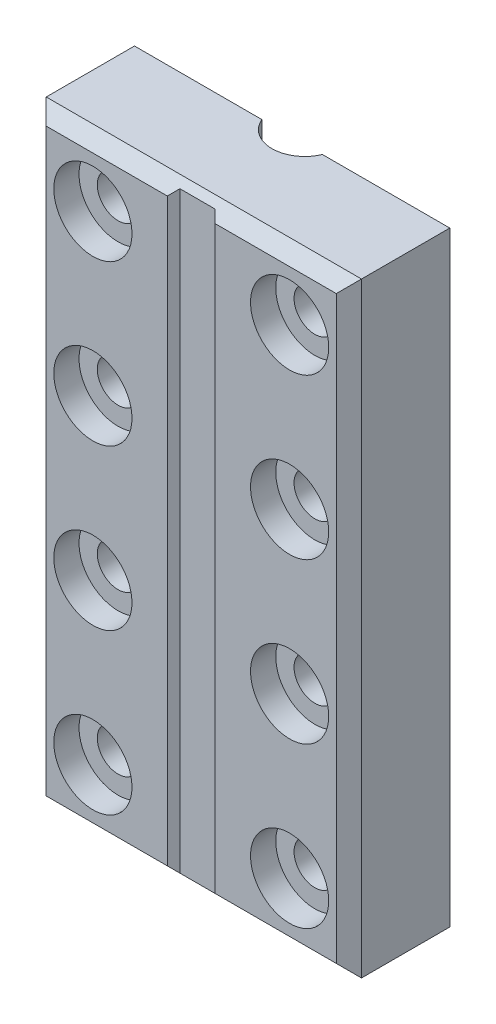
ISO-10303-21;
HEADER;
FILE_DESCRIPTION(('STEP AP214'),'2;1');
FILE_NAME('part.step','',(''),(''),'','','');
FILE_SCHEMA(('AUTOMOTIVE_DESIGN { 1 0 10303 214 1 1 1 1 }'));
ENDSEC;
DATA;
#1=APPLICATION_CONTEXT('core data for automotive mechanical design processes');
#2=APPLICATION_PROTOCOL_DEFINITION('international standard','automotive_design',2000,#1);
#3=PRODUCT_CONTEXT('',#1,'mechanical');
#4=PRODUCT('Part','Part','',(#3));
#5=PRODUCT_RELATED_PRODUCT_CATEGORY('part','',(#4));
#6=PRODUCT_DEFINITION_FORMATION('','',#4);
#7=PRODUCT_DEFINITION_CONTEXT('part definition',#1,'design');
#8=PRODUCT_DEFINITION('design','',#6,#7);
#9=PRODUCT_DEFINITION_SHAPE('','',#8);
#10=(LENGTH_UNIT() NAMED_UNIT(*) SI_UNIT(.MILLI.,.METRE.));
#11=(NAMED_UNIT(*) PLANE_ANGLE_UNIT() SI_UNIT($,.RADIAN.));
#12=(NAMED_UNIT(*) SI_UNIT($,.STERADIAN.) SOLID_ANGLE_UNIT());
#13=UNCERTAINTY_MEASURE_WITH_UNIT(LENGTH_MEASURE(1.E-05),#10,'distance_accuracy_value','');
#14=(GEOMETRIC_REPRESENTATION_CONTEXT(3) GLOBAL_UNCERTAINTY_ASSIGNED_CONTEXT((#13)) GLOBAL_UNIT_ASSIGNED_CONTEXT((#10,
#11,#12)) REPRESENTATION_CONTEXT('',''));
#15=CARTESIAN_POINT('',(0.,0.,0.));
#16=DIRECTION('',(0.,0.,1.));
#17=DIRECTION('',(1.,0.,0.));
#18=AXIS2_PLACEMENT_3D('',#15,#16,#17);
#19=CARTESIAN_POINT('',(-56.3000000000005,-19.0000000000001,8.));
#20=DIRECTION('',(0.,0.,-1.));
#21=DIRECTION('',(-1.,0.,0.));
#22=AXIS2_PLACEMENT_3D('',#19,#20,#21);
#23=CYLINDRICAL_SURFACE('',#22,1.65);
#24=CARTESIAN_POINT('',(-56.3000000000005,-19.0000000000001,0.));
#25=DIRECTION('',(0.,0.,1.));
#26=DIRECTION('',(1.,0.,0.));
#27=AXIS2_PLACEMENT_3D('',#24,#25,#26);
#28=CIRCLE('',#27,1.65);
#29=CARTESIAN_POINT('',(-54.6500000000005,-19.0000000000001,0.));
#30=VERTEX_POINT('',#29);
#31=EDGE_CURVE('E165',#30,#30,#28,.T.);
#32=ORIENTED_EDGE('',*,*,#31,.F.);
#33=EDGE_LOOP('',(#32));
#34=FACE_BOUND('',#33,.T.);
#35=CARTESIAN_POINT('',(-56.3000000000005,-19.0000000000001,6.));
#36=DIRECTION('',(0.,0.,1.));
#37=DIRECTION('',(1.,0.,0.));
#38=AXIS2_PLACEMENT_3D('',#35,#36,#37);
#39=CIRCLE('',#38,1.65);
#40=CARTESIAN_POINT('',(-54.6500000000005,-19.0000000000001,6.));
#41=VERTEX_POINT('',#40);
#42=EDGE_CURVE('E40',#41,#41,#39,.T.);
#43=ORIENTED_EDGE('',*,*,#42,.T.);
#44=EDGE_LOOP('',(#43));
#45=FACE_BOUND('',#44,.T.);
#46=ADVANCED_FACE('F35',(#34,#45),#23,.F.);
#47=CARTESIAN_POINT('',(-56.3000000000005,-31.6666666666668,8.));
#48=DIRECTION('',(0.,0.,-1.));
#49=DIRECTION('',(-1.,0.,0.));
#50=AXIS2_PLACEMENT_3D('',#47,#48,#49);
#51=CYLINDRICAL_SURFACE('',#50,1.65);
#52=CARTESIAN_POINT('',(-56.3000000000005,-31.6666666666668,0.));
#53=DIRECTION('',(0.,0.,1.));
#54=DIRECTION('',(1.,0.,0.));
#55=AXIS2_PLACEMENT_3D('',#52,#53,#54);
#56=CIRCLE('',#55,1.65);
#57=CARTESIAN_POINT('',(-54.6500000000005,-31.6666666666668,0.));
#58=VERTEX_POINT('',#57);
#59=EDGE_CURVE('E162',#58,#58,#56,.T.);
#60=ORIENTED_EDGE('',*,*,#59,.F.);
#61=EDGE_LOOP('',(#60));
#62=FACE_BOUND('',#61,.T.);
#63=CARTESIAN_POINT('',(-56.3000000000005,-31.6666666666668,6.));
#64=DIRECTION('',(0.,0.,1.));
#65=DIRECTION('',(1.,0.,0.));
#66=AXIS2_PLACEMENT_3D('',#63,#64,#65);
#67=CIRCLE('',#66,1.65);
#68=CARTESIAN_POINT('',(-54.6500000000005,-31.6666666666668,6.));
#69=VERTEX_POINT('',#68);
#70=EDGE_CURVE('E255',#69,#69,#67,.T.);
#71=ORIENTED_EDGE('',*,*,#70,.T.);
#72=EDGE_LOOP('',(#71));
#73=FACE_BOUND('',#72,.T.);
#74=ADVANCED_FACE('F421',(#62,#73),#51,.F.);
#75=CARTESIAN_POINT('',(-56.3000000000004,-44.3333333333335,8.));
#76=DIRECTION('',(0.,0.,-1.));
#77=DIRECTION('',(-1.,0.,0.));
#78=AXIS2_PLACEMENT_3D('',#75,#76,#77);
#79=CYLINDRICAL_SURFACE('',#78,1.65);
#80=CARTESIAN_POINT('',(-56.3000000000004,-44.3333333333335,0.));
#81=DIRECTION('',(0.,0.,1.));
#82=DIRECTION('',(1.,0.,0.));
#83=AXIS2_PLACEMENT_3D('',#80,#81,#82);
#84=CIRCLE('',#83,1.65);
#85=CARTESIAN_POINT('',(-54.6500000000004,-44.3333333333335,0.));
#86=VERTEX_POINT('',#85);
#87=EDGE_CURVE('E159',#86,#86,#84,.T.);
#88=ORIENTED_EDGE('',*,*,#87,.F.);
#89=EDGE_LOOP('',(#88));
#90=FACE_BOUND('',#89,.T.);
#91=CARTESIAN_POINT('',(-56.3000000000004,-44.3333333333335,6.));
#92=DIRECTION('',(0.,0.,1.));
#93=DIRECTION('',(1.,0.,0.));
#94=AXIS2_PLACEMENT_3D('',#91,#92,#93);
#95=CIRCLE('',#94,1.65);
#96=CARTESIAN_POINT('',(-54.6500000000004,-44.3333333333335,6.));
#97=VERTEX_POINT('',#96);
#98=EDGE_CURVE('E253',#97,#97,#95,.T.);
#99=ORIENTED_EDGE('',*,*,#98,.T.);
#100=EDGE_LOOP('',(#99));
#101=FACE_BOUND('',#100,.T.);
#102=ADVANCED_FACE('F427',(#90,#101),#79,.F.);
#103=CARTESIAN_POINT('',(-56.3000000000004,-57.0000000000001,8.));
#104=DIRECTION('',(0.,0.,-1.));
#105=DIRECTION('',(-1.,0.,0.));
#106=AXIS2_PLACEMENT_3D('',#103,#104,#105);
#107=CYLINDRICAL_SURFACE('',#106,1.65);
#108=CARTESIAN_POINT('',(-56.3000000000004,-57.0000000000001,0.));
#109=DIRECTION('',(0.,0.,1.));
#110=DIRECTION('',(1.,0.,0.));
#111=AXIS2_PLACEMENT_3D('',#108,#109,#110);
#112=CIRCLE('',#111,1.65);
#113=CARTESIAN_POINT('',(-54.6500000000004,-57.0000000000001,0.));
#114=VERTEX_POINT('',#113);
#115=EDGE_CURVE('E156',#114,#114,#112,.T.);
#116=ORIENTED_EDGE('',*,*,#115,.F.);
#117=EDGE_LOOP('',(#116));
#118=FACE_BOUND('',#117,.T.);
#119=CARTESIAN_POINT('',(-56.3000000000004,-57.0000000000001,6.));
#120=DIRECTION('',(0.,0.,1.));
#121=DIRECTION('',(1.,0.,0.));
#122=AXIS2_PLACEMENT_3D('',#119,#120,#121);
#123=CIRCLE('',#122,1.65);
#124=CARTESIAN_POINT('',(-54.6500000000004,-57.0000000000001,6.));
#125=VERTEX_POINT('',#124);
#126=EDGE_CURVE('E250',#125,#125,#123,.T.);
#127=ORIENTED_EDGE('',*,*,#126,.T.);
#128=EDGE_LOOP('',(#127));
#129=FACE_BOUND('',#128,.T.);
#130=ADVANCED_FACE('F295',(#118,#129),#107,.F.);
#131=CARTESIAN_POINT('',(-40.7,-19.0000000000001,8.));
#132=DIRECTION('',(0.,0.,-1.));
#133=DIRECTION('',(-1.,0.,0.));
#134=AXIS2_PLACEMENT_3D('',#131,#132,#133);
#135=CYLINDRICAL_SURFACE('',#134,1.65);
#136=CARTESIAN_POINT('',(-40.7,-19.0000000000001,0.));
#137=DIRECTION('',(0.,0.,1.));
#138=DIRECTION('',(1.,0.,0.));
#139=AXIS2_PLACEMENT_3D('',#136,#137,#138);
#140=CIRCLE('',#139,1.65);
#141=CARTESIAN_POINT('',(-39.05,-19.0000000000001,0.));
#142=VERTEX_POINT('',#141);
#143=EDGE_CURVE('E140',#142,#142,#140,.T.);
#144=ORIENTED_EDGE('',*,*,#143,.F.);
#145=EDGE_LOOP('',(#144));
#146=FACE_BOUND('',#145,.T.);
#147=CARTESIAN_POINT('',(-40.7,-19.0000000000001,6.));
#148=DIRECTION('',(0.,0.,1.));
#149=DIRECTION('',(1.,0.,0.));
#150=AXIS2_PLACEMENT_3D('',#147,#148,#149);
#151=CIRCLE('',#150,1.65);
#152=CARTESIAN_POINT('',(-39.05,-19.0000000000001,6.));
#153=VERTEX_POINT('',#152);
#154=EDGE_CURVE('E247',#153,#153,#151,.T.);
#155=ORIENTED_EDGE('',*,*,#154,.T.);
#156=EDGE_LOOP('',(#155));
#157=FACE_BOUND('',#156,.T.);
#158=ADVANCED_FACE('F291',(#146,#157),#135,.F.);
#159=CARTESIAN_POINT('',(-40.6999999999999,-31.6666666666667,8.));
#160=DIRECTION('',(0.,0.,-1.));
#161=DIRECTION('',(-1.,0.,0.));
#162=AXIS2_PLACEMENT_3D('',#159,#160,#161);
#163=CYLINDRICAL_SURFACE('',#162,1.65);
#164=CARTESIAN_POINT('',(-40.6999999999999,-31.6666666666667,0.));
#165=DIRECTION('',(0.,0.,1.));
#166=DIRECTION('',(1.,0.,0.));
#167=AXIS2_PLACEMENT_3D('',#164,#165,#166);
#168=CIRCLE('',#167,1.65);
#169=CARTESIAN_POINT('',(-39.0499999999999,-31.6666666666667,0.));
#170=VERTEX_POINT('',#169);
#171=EDGE_CURVE('E285',#170,#170,#168,.T.);
#172=ORIENTED_EDGE('',*,*,#171,.F.);
#173=EDGE_LOOP('',(#172));
#174=FACE_BOUND('',#173,.T.);
#175=CARTESIAN_POINT('',(-40.6999999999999,-31.6666666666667,6.));
#176=DIRECTION('',(0.,0.,1.));
#177=DIRECTION('',(1.,0.,0.));
#178=AXIS2_PLACEMENT_3D('',#175,#176,#177);
#179=CIRCLE('',#178,1.65);
#180=CARTESIAN_POINT('',(-39.0499999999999,-31.6666666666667,6.));
#181=VERTEX_POINT('',#180);
#182=EDGE_CURVE('E244',#181,#181,#179,.T.);
#183=ORIENTED_EDGE('',*,*,#182,.T.);
#184=EDGE_LOOP('',(#183));
#185=FACE_BOUND('',#184,.T.);
#186=ADVANCED_FACE('F294',(#174,#185),#163,.F.);
#187=CARTESIAN_POINT('',(-40.6999999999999,-44.3333333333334,8.));
#188=DIRECTION('',(0.,0.,-1.));
#189=DIRECTION('',(-1.,0.,0.));
#190=AXIS2_PLACEMENT_3D('',#187,#188,#189);
#191=CYLINDRICAL_SURFACE('',#190,1.65);
#192=CARTESIAN_POINT('',(-40.6999999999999,-44.3333333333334,0.));
#193=DIRECTION('',(0.,0.,1.));
#194=DIRECTION('',(1.,0.,0.));
#195=AXIS2_PLACEMENT_3D('',#192,#193,#194);
#196=CIRCLE('',#195,1.65);
#197=CARTESIAN_POINT('',(-39.0499999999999,-44.3333333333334,0.));
#198=VERTEX_POINT('',#197);
#199=EDGE_CURVE('E282',#198,#198,#196,.T.);
#200=ORIENTED_EDGE('',*,*,#199,.F.);
#201=EDGE_LOOP('',(#200));
#202=FACE_BOUND('',#201,.T.);
#203=CARTESIAN_POINT('',(-40.6999999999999,-44.3333333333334,6.));
#204=DIRECTION('',(0.,0.,1.));
#205=DIRECTION('',(1.,0.,0.));
#206=AXIS2_PLACEMENT_3D('',#203,#204,#205);
#207=CIRCLE('',#206,1.65);
#208=CARTESIAN_POINT('',(-39.0499999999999,-44.3333333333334,6.));
#209=VERTEX_POINT('',#208);
#210=EDGE_CURVE('E240',#209,#209,#207,.T.);
#211=ORIENTED_EDGE('',*,*,#210,.T.);
#212=EDGE_LOOP('',(#211));
#213=FACE_BOUND('',#212,.T.);
#214=ADVANCED_FACE('F567',(#202,#213),#191,.F.);
#215=CARTESIAN_POINT('',(-40.6999999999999,-57.0000000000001,8.));
#216=DIRECTION('',(0.,0.,-1.));
#217=DIRECTION('',(-1.,0.,0.));
#218=AXIS2_PLACEMENT_3D('',#215,#216,#217);
#219=CYLINDRICAL_SURFACE('',#218,1.65);
#220=CARTESIAN_POINT('',(-40.6999999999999,-57.0000000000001,0.));
#221=DIRECTION('',(0.,0.,1.));
#222=DIRECTION('',(1.,0.,0.));
#223=AXIS2_PLACEMENT_3D('',#220,#221,#222);
#224=CIRCLE('',#223,1.65);
#225=CARTESIAN_POINT('',(-39.0499999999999,-57.0000000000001,0.));
#226=VERTEX_POINT('',#225);
#227=EDGE_CURVE('E236',#226,#226,#224,.T.);
#228=ORIENTED_EDGE('',*,*,#227,.F.);
#229=EDGE_LOOP('',(#228));
#230=FACE_BOUND('',#229,.T.);
#231=CARTESIAN_POINT('',(-40.6999999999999,-57.0000000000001,6.));
#232=DIRECTION('',(0.,0.,1.));
#233=DIRECTION('',(1.,0.,0.));
#234=AXIS2_PLACEMENT_3D('',#231,#232,#233);
#235=CIRCLE('',#234,1.65);
#236=CARTESIAN_POINT('',(-39.0499999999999,-57.0000000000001,6.));
#237=VERTEX_POINT('',#236);
#238=EDGE_CURVE('E237',#237,#237,#235,.T.);
#239=ORIENTED_EDGE('',*,*,#238,.T.);
#240=EDGE_LOOP('',(#239));
#241=FACE_BOUND('',#240,.T.);
#242=ADVANCED_FACE('F436',(#230,#241),#219,.F.);
#243=CARTESIAN_POINT('',(0.,0.,8.));
#244=DIRECTION('',(0.,0.,1.));
#245=DIRECTION('',(1.,0.,0.));
#246=AXIS2_PLACEMENT_3D('',#243,#244,#245);
#247=PLANE('',#246);
#248=CARTESIAN_POINT('',(-56.3000000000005,-31.6666666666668,8.));
#249=DIRECTION('',(0.,0.,1.));
#250=DIRECTION('',(1.,0.,0.));
#251=AXIS2_PLACEMENT_3D('',#248,#249,#250);
#252=CIRCLE('',#251,3.09999999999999);
#253=CARTESIAN_POINT('',(-53.2000000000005,-31.6666666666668,8.));
#254=VERTEX_POINT('',#253);
#255=EDGE_CURVE('E277',#254,#254,#252,.T.);
#256=ORIENTED_EDGE('',*,*,#255,.F.);
#257=EDGE_LOOP('',(#256));
#258=FACE_BOUND('',#257,.T.);
#259=CARTESIAN_POINT('',(-56.3000000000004,-44.3333333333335,8.));
#260=DIRECTION('',(0.,0.,1.));
#261=DIRECTION('',(1.,0.,0.));
#262=AXIS2_PLACEMENT_3D('',#259,#260,#261);
#263=CIRCLE('',#262,3.09999999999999);
#264=CARTESIAN_POINT('',(-53.2000000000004,-44.3333333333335,8.));
#265=VERTEX_POINT('',#264);
#266=EDGE_CURVE('E342',#265,#265,#263,.T.);
#267=ORIENTED_EDGE('',*,*,#266,.F.);
#268=EDGE_LOOP('',(#267));
#269=FACE_BOUND('',#268,.T.);
#270=CARTESIAN_POINT('',(-56.3000000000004,-57.0000000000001,8.));
#271=DIRECTION('',(0.,0.,1.));
#272=DIRECTION('',(1.,0.,0.));
#273=AXIS2_PLACEMENT_3D('',#270,#271,#272);
#274=CIRCLE('',#273,3.09999999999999);
#275=CARTESIAN_POINT('',(-53.2000000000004,-57.0000000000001,8.));
#276=VERTEX_POINT('',#275);
#277=EDGE_CURVE('E352',#276,#276,#274,.T.);
#278=ORIENTED_EDGE('',*,*,#277,.F.);
#279=EDGE_LOOP('',(#278));
#280=FACE_BOUND('',#279,.T.);
#281=CARTESIAN_POINT('',(-56.3000000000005,-19.0000000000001,8.));
#282=DIRECTION('',(0.,0.,1.));
#283=DIRECTION('',(1.,0.,0.));
#284=AXIS2_PLACEMENT_3D('',#281,#282,#283);
#285=CIRCLE('',#284,3.09999999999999);
#286=CARTESIAN_POINT('',(-53.2000000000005,-19.0000000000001,8.));
#287=VERTEX_POINT('',#286);
#288=EDGE_CURVE('E271',#287,#287,#285,.T.);
#289=ORIENTED_EDGE('',*,*,#288,.F.);
#290=EDGE_LOOP('',(#289));
#291=FACE_BOUND('',#290,.T.);
#292=DIRECTION('',(0.,1.,0.));
#293=VECTOR('',#292,1.);
#294=CARTESIAN_POINT('',(-50.4000000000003,-14.,8.));
#295=LINE('',#294,#293);
#296=CARTESIAN_POINT('',(-50.4000000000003,-61.0000000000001,8.));
#297=VERTEX_POINT('',#296);
#298=CARTESIAN_POINT('',(-50.4000000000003,-15.,8.));
#299=VERTEX_POINT('',#298);
#300=EDGE_CURVE('E192',#297,#299,#295,.T.);
#301=ORIENTED_EDGE('',*,*,#300,.T.);
#302=DIRECTION('',(1.,0.,0.));
#303=VECTOR('',#302,1.);
#304=CARTESIAN_POINT('',(0.,-14.9999999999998,8.));
#305=LINE('',#304,#303);
#306=CARTESIAN_POINT('',(-60.0000000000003,-15.,8.));
#307=VERTEX_POINT('',#306);
#308=EDGE_CURVE('E218',#299,#307,#305,.F.);
#309=ORIENTED_EDGE('',*,*,#308,.T.);
#310=DIRECTION('',(0.,-1.,0.));
#311=VECTOR('',#310,1.);
#312=CARTESIAN_POINT('',(-60.0000000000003,-62.0000000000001,8.));
#313=LINE('',#312,#311);
#314=CARTESIAN_POINT('',(-60.0000000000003,-61.0000000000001,8.));
#315=VERTEX_POINT('',#314);
#316=EDGE_CURVE('E214',#307,#315,#313,.T.);
#317=ORIENTED_EDGE('',*,*,#316,.T.);
#318=DIRECTION('',(1.,0.,0.));
#319=VECTOR('',#318,1.);
#320=CARTESIAN_POINT('',(-50.4000000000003,-61.0000000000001,8.));
#321=LINE('',#320,#319);
#322=EDGE_CURVE('E216',#315,#297,#321,.T.);
#323=ORIENTED_EDGE('',*,*,#322,.T.);
#324=EDGE_LOOP('',(#301,#309,#317,#323));
#325=FACE_BOUND('',#324,.T.);
#326=ADVANCED_FACE('F407',(#258,#269,#280,#291,#325),#247,.T.);
#327=CARTESIAN_POINT('',(0.,0.,0.));
#328=DIRECTION('',(0.,0.,1.));
#329=DIRECTION('',(1.,0.,0.));
#330=AXIS2_PLACEMENT_3D('',#327,#328,#329);
#331=PLANE('',#330);
#332=DIRECTION('',(-1.,0.,0.));
#333=VECTOR('',#332,1.);
#334=CARTESIAN_POINT('',(-50.9000000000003,-14.,0.));
#335=LINE('',#334,#333);
#336=CARTESIAN_POINT('',(-50.9000000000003,-14.,0.));
#337=VERTEX_POINT('',#336);
#338=CARTESIAN_POINT('',(-61.0000000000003,-14.0000000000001,0.));
#339=VERTEX_POINT('',#338);
#340=EDGE_CURVE('E168',#337,#339,#335,.T.);
#341=ORIENTED_EDGE('',*,*,#340,.F.);
#342=DIRECTION('',(0.,1.,0.));
#343=VECTOR('',#342,1.);
#344=CARTESIAN_POINT('',(-50.9000000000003,-62.0000000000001,0.));
#345=LINE('',#344,#343);
#346=CARTESIAN_POINT('',(-50.9000000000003,-62.0000000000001,0.));
#347=VERTEX_POINT('',#346);
#348=EDGE_CURVE('E176',#347,#337,#345,.T.);
#349=ORIENTED_EDGE('',*,*,#348,.F.);
#350=DIRECTION('',(1.,0.,0.));
#351=VECTOR('',#350,1.);
#352=CARTESIAN_POINT('',(-61.0000000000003,-62.0000000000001,0.));
#353=LINE('',#352,#351);
#354=CARTESIAN_POINT('',(-61.0000000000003,-62.0000000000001,0.));
#355=VERTEX_POINT('',#354);
#356=EDGE_CURVE('E174',#355,#347,#353,.T.);
#357=ORIENTED_EDGE('',*,*,#356,.F.);
#358=DIRECTION('',(0.,-1.,0.));
#359=VECTOR('',#358,1.);
#360=CARTESIAN_POINT('',(-61.0000000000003,-14.0000000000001,0.));
#361=LINE('',#360,#359);
#362=EDGE_CURVE('E171',#339,#355,#361,.T.);
#363=ORIENTED_EDGE('',*,*,#362,.F.);
#364=EDGE_LOOP('',(#341,#349,#357,#363));
#365=FACE_BOUND('',#364,.T.);
#366=ORIENTED_EDGE('',*,*,#31,.T.);
#367=EDGE_LOOP('',(#366));
#368=FACE_BOUND('',#367,.T.);
#369=ORIENTED_EDGE('',*,*,#59,.T.);
#370=EDGE_LOOP('',(#369));
#371=FACE_BOUND('',#370,.T.);
#372=ORIENTED_EDGE('',*,*,#87,.T.);
#373=EDGE_LOOP('',(#372));
#374=FACE_BOUND('',#373,.T.);
#375=ORIENTED_EDGE('',*,*,#115,.T.);
#376=EDGE_LOOP('',(#375));
#377=FACE_BOUND('',#376,.T.);
#378=ADVANCED_FACE('F435',(#365,#368,#371,#374,#377),#331,.F.);
#379=CARTESIAN_POINT('',(-50.9000000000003,-14.,8.));
#380=DIRECTION('',(0.,-1.,0.));
#381=DIRECTION('',(1.,0.,0.));
#382=AXIS2_PLACEMENT_3D('',#379,#380,#381);
#383=PLANE('',#382);
#384=DIRECTION('',(0.,0.,-1.));
#385=VECTOR('',#384,1.);
#386=CARTESIAN_POINT('',(-61.0000000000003,-14.0000000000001,8.));
#387=LINE('',#386,#385);
#388=CARTESIAN_POINT('',(-61.0000000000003,-14.0000000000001,7.00000000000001));
#389=VERTEX_POINT('',#388);
#390=EDGE_CURVE('E181',#389,#339,#387,.T.);
#391=ORIENTED_EDGE('',*,*,#390,.F.);
#392=DIRECTION('',(1.,0.,0.));
#393=VECTOR('',#392,1.);
#394=CARTESIAN_POINT('',(-50.9000000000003,-14.,7.));
#395=LINE('',#394,#393);
#396=CARTESIAN_POINT('',(-36.0000000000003,-14.0000000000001,7.));
#397=VERTEX_POINT('',#396);
#398=EDGE_CURVE('E220',#389,#397,#395,.T.);
#399=ORIENTED_EDGE('',*,*,#398,.T.);
#400=DIRECTION('',(0.,0.,-1.));
#401=VECTOR('',#400,1.);
#402=CARTESIAN_POINT('',(-36.0000000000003,-14.0000000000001,8.));
#403=LINE('',#402,#401);
#404=CARTESIAN_POINT('',(-36.0000000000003,-14.0000000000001,0.));
#405=VERTEX_POINT('',#404);
#406=EDGE_CURVE('E131',#397,#405,#403,.T.);
#407=ORIENTED_EDGE('',*,*,#406,.T.);
#408=DIRECTION('',(-1.,0.,0.));
#409=VECTOR('',#408,1.);
#410=CARTESIAN_POINT('',(-46.1000000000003,-14.,0.));
#411=LINE('',#410,#409);
#412=CARTESIAN_POINT('',(-46.1000000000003,-14.,0.));
#413=VERTEX_POINT('',#412);
#414=EDGE_CURVE('E145',#405,#413,#411,.T.);
#415=ORIENTED_EDGE('',*,*,#414,.T.);
#416=CARTESIAN_POINT('',(-48.5,-14.,-0.999999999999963));
#417=DIRECTION('',(0.,1.,0.));
#418=DIRECTION('',(0.,0.,1.));
#419=AXIS2_PLACEMENT_3D('',#416,#417,#418);
#420=CIRCLE('',#419,2.59999999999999);
#421=EDGE_CURVE('E151',#337,#413,#420,.T.);
#422=ORIENTED_EDGE('',*,*,#421,.F.);
#423=ORIENTED_EDGE('',*,*,#340,.T.);
#424=EDGE_LOOP('',(#391,#399,#407,#415,#422,#423));
#425=FACE_BOUND('',#424,.T.);
#426=ADVANCED_FACE('F403',(#425),#383,.F.);
#427=CARTESIAN_POINT('',(-61.0000000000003,-14.0000000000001,8.));
#428=DIRECTION('',(1.,0.,0.));
#429=DIRECTION('',(0.,1.,0.));
#430=AXIS2_PLACEMENT_3D('',#427,#428,#429);
#431=PLANE('',#430);
#432=DIRECTION('',(0.,0.,-1.));
#433=VECTOR('',#432,1.);
#434=CARTESIAN_POINT('',(-61.0000000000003,-62.0000000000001,8.));
#435=LINE('',#434,#433);
#436=CARTESIAN_POINT('',(-61.0000000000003,-62.0000000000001,7.00000000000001));
#437=VERTEX_POINT('',#436);
#438=EDGE_CURVE('E179',#437,#355,#435,.T.);
#439=ORIENTED_EDGE('',*,*,#438,.F.);
#440=DIRECTION('',(0.,1.,0.));
#441=VECTOR('',#440,1.);
#442=CARTESIAN_POINT('',(-61.0000000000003,-14.0000000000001,7.00000000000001));
#443=LINE('',#442,#441);
#444=EDGE_CURVE('E11',#437,#389,#443,.T.);
#445=ORIENTED_EDGE('',*,*,#444,.T.);
#446=ORIENTED_EDGE('',*,*,#390,.T.);
#447=ORIENTED_EDGE('',*,*,#362,.T.);
#448=EDGE_LOOP('',(#439,#445,#446,#447));
#449=FACE_BOUND('',#448,.T.);
#450=ADVANCED_FACE('F400',(#449),#431,.F.);
#451=CARTESIAN_POINT('',(-61.0000000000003,-62.0000000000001,8.));
#452=DIRECTION('',(0.,1.,0.));
#453=DIRECTION('',(-1.,0.,0.));
#454=AXIS2_PLACEMENT_3D('',#451,#452,#453);
#455=PLANE('',#454);
#456=DIRECTION('',(0.,0.,-1.));
#457=VECTOR('',#456,1.);
#458=CARTESIAN_POINT('',(-36.0000000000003,-62.0000000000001,8.));
#459=LINE('',#458,#457);
#460=CARTESIAN_POINT('',(-36.0000000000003,-62.0000000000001,7.00000000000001));
#461=VERTEX_POINT('',#460);
#462=CARTESIAN_POINT('',(-36.0000000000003,-62.0000000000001,0.));
#463=VERTEX_POINT('',#462);
#464=EDGE_CURVE('E124',#461,#463,#459,.T.);
#465=ORIENTED_EDGE('',*,*,#464,.F.);
#466=DIRECTION('',(-1.,0.,0.));
#467=VECTOR('',#466,1.);
#468=CARTESIAN_POINT('',(-61.0000000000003,-62.0000000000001,7.00000000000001));
#469=LINE('',#468,#467);
#470=EDGE_CURVE('E45',#461,#437,#469,.T.);
#471=ORIENTED_EDGE('',*,*,#470,.T.);
#472=ORIENTED_EDGE('',*,*,#438,.T.);
#473=ORIENTED_EDGE('',*,*,#356,.T.);
#474=CARTESIAN_POINT('',(-48.5,-62.,-0.999999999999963));
#475=DIRECTION('',(0.,1.,0.));
#476=DIRECTION('',(0.,0.,1.));
#477=AXIS2_PLACEMENT_3D('',#474,#475,#476);
#478=CIRCLE('',#477,2.59999999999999);
#479=CARTESIAN_POINT('',(-46.1000000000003,-62.,0.));
#480=VERTEX_POINT('',#479);
#481=EDGE_CURVE('E130',#347,#480,#478,.T.);
#482=ORIENTED_EDGE('',*,*,#481,.T.);
#483=DIRECTION('',(1.,0.,0.));
#484=VECTOR('',#483,1.);
#485=CARTESIAN_POINT('',(-36.0000000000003,-62.0000000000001,0.));
#486=LINE('',#485,#484);
#487=EDGE_CURVE('E135',#480,#463,#486,.T.);
#488=ORIENTED_EDGE('',*,*,#487,.T.);
#489=EDGE_LOOP('',(#465,#471,#472,#473,#482,#488));
#490=FACE_BOUND('',#489,.T.);
#491=ADVANCED_FACE('F136',(#490),#455,.F.);
#492=CARTESIAN_POINT('',(-48.5,-14.,-0.999999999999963));
#493=DIRECTION('',(0.,-1.,0.));
#494=DIRECTION('',(0.,0.,-1.));
#495=AXIS2_PLACEMENT_3D('',#492,#493,#494);
#496=CYLINDRICAL_SURFACE('',#495,2.59999999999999);
#497=ORIENTED_EDGE('',*,*,#481,.F.);
#498=ORIENTED_EDGE('',*,*,#348,.T.);
#499=ORIENTED_EDGE('',*,*,#421,.T.);
#500=DIRECTION('',(0.,-1.,0.));
#501=VECTOR('',#500,1.);
#502=CARTESIAN_POINT('',(-46.1000000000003,-14.,0.));
#503=LINE('',#502,#501);
#504=EDGE_CURVE('E153',#413,#480,#503,.T.);
#505=ORIENTED_EDGE('',*,*,#504,.T.);
#506=EDGE_LOOP('',(#497,#498,#499,#505));
#507=FACE_BOUND('',#506,.T.);
#508=ADVANCED_FACE('F443',(#507),#496,.F.);
#509=CARTESIAN_POINT('',(-50.9000000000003,-14.,7.5));
#510=DIRECTION('',(0.,0.,1.));
#511=DIRECTION('',(1.,0.,0.));
#512=AXIS2_PLACEMENT_3D('',#509,#510,#511);
#513=PLANE('',#512);
#514=DIRECTION('',(0.,1.,0.));
#515=VECTOR('',#514,1.);
#516=CARTESIAN_POINT('',(-47.1000000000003,-14.,7.5));
#517=LINE('',#516,#515);
#518=CARTESIAN_POINT('',(-47.1000000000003,-61.5000000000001,7.5));
#519=VERTEX_POINT('',#518);
#520=CARTESIAN_POINT('',(-47.1000000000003,-14.5,7.5));
#521=VERTEX_POINT('',#520);
#522=EDGE_CURVE('E186',#519,#521,#517,.T.);
#523=ORIENTED_EDGE('',*,*,#522,.T.);
#524=DIRECTION('',(1.,0.,0.));
#525=VECTOR('',#524,1.);
#526=CARTESIAN_POINT('',(-50.9000000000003,-14.5,7.5));
#527=LINE('',#526,#525);
#528=CARTESIAN_POINT('',(-49.9000000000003,-14.5,7.5));
#529=VERTEX_POINT('',#528);
#530=EDGE_CURVE('E208',#521,#529,#527,.F.);
#531=ORIENTED_EDGE('',*,*,#530,.T.);
#532=DIRECTION('',(0.,-1.,0.));
#533=VECTOR('',#532,1.);
#534=CARTESIAN_POINT('',(-49.9000000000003,-14.,7.5));
#535=LINE('',#534,#533);
#536=CARTESIAN_POINT('',(-49.9000000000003,-61.5000000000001,7.5));
#537=VERTEX_POINT('',#536);
#538=EDGE_CURVE('E183',#529,#537,#535,.T.);
#539=ORIENTED_EDGE('',*,*,#538,.T.);
#540=DIRECTION('',(1.,0.,0.));
#541=VECTOR('',#540,1.);
#542=CARTESIAN_POINT('',(-50.9000000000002,-61.5000000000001,7.5));
#543=LINE('',#542,#541);
#544=EDGE_CURVE('E206',#537,#519,#543,.T.);
#545=ORIENTED_EDGE('',*,*,#544,.T.);
#546=EDGE_LOOP('',(#523,#531,#539,#545));
#547=FACE_BOUND('',#546,.T.);
#548=ADVANCED_FACE('F366',(#547),#513,.T.);
#549=CARTESIAN_POINT('',(0.,0.,8.));
#550=DIRECTION('',(0.,0.,-1.));
#551=DIRECTION('',(-1.,0.,0.));
#552=AXIS2_PLACEMENT_3D('',#549,#550,#551);
#553=PLANE('',#552);
#554=CARTESIAN_POINT('',(-40.6999999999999,-44.3333333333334,8.));
#555=DIRECTION('',(0.,0.,1.));
#556=DIRECTION('',(1.,0.,0.));
#557=AXIS2_PLACEMENT_3D('',#554,#555,#556);
#558=CIRCLE('',#557,3.09999999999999);
#559=CARTESIAN_POINT('',(-37.5999999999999,-44.3333333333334,8.));
#560=VERTEX_POINT('',#559);
#561=EDGE_CURVE('E314',#560,#560,#558,.T.);
#562=ORIENTED_EDGE('',*,*,#561,.F.);
#563=EDGE_LOOP('',(#562));
#564=FACE_BOUND('',#563,.T.);
#565=CARTESIAN_POINT('',(-40.6999999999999,-31.6666666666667,8.));
#566=DIRECTION('',(0.,0.,1.));
#567=DIRECTION('',(1.,0.,0.));
#568=AXIS2_PLACEMENT_3D('',#565,#566,#567);
#569=CIRCLE('',#568,3.09999999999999);
#570=CARTESIAN_POINT('',(-37.5999999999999,-31.6666666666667,8.));
#571=VERTEX_POINT('',#570);
#572=EDGE_CURVE('E324',#571,#571,#569,.T.);
#573=ORIENTED_EDGE('',*,*,#572,.F.);
#574=EDGE_LOOP('',(#573));
#575=FACE_BOUND('',#574,.T.);
#576=CARTESIAN_POINT('',(-40.7,-19.0000000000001,8.));
#577=DIRECTION('',(0.,0.,1.));
#578=DIRECTION('',(1.,0.,0.));
#579=AXIS2_PLACEMENT_3D('',#576,#577,#578);
#580=CIRCLE('',#579,3.09999999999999);
#581=CARTESIAN_POINT('',(-37.6,-19.0000000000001,8.));
#582=VERTEX_POINT('',#581);
#583=EDGE_CURVE('E308',#582,#582,#580,.T.);
#584=ORIENTED_EDGE('',*,*,#583,.F.);
#585=EDGE_LOOP('',(#584));
#586=FACE_BOUND('',#585,.T.);
#587=CARTESIAN_POINT('',(-40.6999999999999,-57.0000000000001,8.));
#588=DIRECTION('',(0.,0.,1.));
#589=DIRECTION('',(1.,0.,0.));
#590=AXIS2_PLACEMENT_3D('',#587,#588,#589);
#591=CIRCLE('',#590,3.09999999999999);
#592=CARTESIAN_POINT('',(-37.5999999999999,-57.0000000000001,8.));
#593=VERTEX_POINT('',#592);
#594=EDGE_CURVE('E332',#593,#593,#591,.T.);
#595=ORIENTED_EDGE('',*,*,#594,.F.);
#596=EDGE_LOOP('',(#595));
#597=FACE_BOUND('',#596,.T.);
#598=DIRECTION('',(0.,1.,0.));
#599=VECTOR('',#598,1.);
#600=CARTESIAN_POINT('',(-37.0000000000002,0.,8.));
#601=LINE('',#600,#599);
#602=CARTESIAN_POINT('',(-37.0000000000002,-61.0000000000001,8.));
#603=VERTEX_POINT('',#602);
#604=CARTESIAN_POINT('',(-37.0000000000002,-15.,8.));
#605=VERTEX_POINT('',#604);
#606=EDGE_CURVE('E197',#603,#605,#601,.T.);
#607=ORIENTED_EDGE('',*,*,#606,.T.);
#608=DIRECTION('',(-1.,0.,0.));
#609=VECTOR('',#608,1.);
#610=CARTESIAN_POINT('',(0.,-14.9999999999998,8.));
#611=LINE('',#610,#609);
#612=CARTESIAN_POINT('',(-46.6000000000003,-15.,8.));
#613=VERTEX_POINT('',#612);
#614=EDGE_CURVE('E199',#605,#613,#611,.T.);
#615=ORIENTED_EDGE('',*,*,#614,.T.);
#616=DIRECTION('',(0.,-1.,0.));
#617=VECTOR('',#616,1.);
#618=CARTESIAN_POINT('',(-46.6000000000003,0.,8.));
#619=LINE('',#618,#617);
#620=CARTESIAN_POINT('',(-46.6000000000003,-61.0000000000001,8.));
#621=VERTEX_POINT('',#620);
#622=EDGE_CURVE('E189',#613,#621,#619,.T.);
#623=ORIENTED_EDGE('',*,*,#622,.T.);
#624=DIRECTION('',(1.,0.,0.));
#625=VECTOR('',#624,1.);
#626=CARTESIAN_POINT('',(0.,-61.,8.));
#627=LINE('',#626,#625);
#628=EDGE_CURVE('E195',#621,#603,#627,.T.);
#629=ORIENTED_EDGE('',*,*,#628,.T.);
#630=EDGE_LOOP('',(#607,#615,#623,#629));
#631=FACE_BOUND('',#630,.T.);
#632=ADVANCED_FACE('F363',(#564,#575,#586,#597,#631),#553,.F.);
#633=CARTESIAN_POINT('',(0.,0.,0.));
#634=DIRECTION('',(0.,0.,-1.));
#635=DIRECTION('',(-1.,0.,0.));
#636=AXIS2_PLACEMENT_3D('',#633,#634,#635);
#637=PLANE('',#636);
#638=ORIENTED_EDGE('',*,*,#199,.T.);
#639=EDGE_LOOP('',(#638));
#640=FACE_BOUND('',#639,.T.);
#641=ORIENTED_EDGE('',*,*,#143,.T.);
#642=EDGE_LOOP('',(#641));
#643=FACE_BOUND('',#642,.T.);
#644=ORIENTED_EDGE('',*,*,#504,.F.);
#645=ORIENTED_EDGE('',*,*,#414,.F.);
#646=DIRECTION('',(0.,1.,0.));
#647=VECTOR('',#646,1.);
#648=CARTESIAN_POINT('',(-36.0000000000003,-62.0000000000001,0.));
#649=LINE('',#648,#647);
#650=EDGE_CURVE('E128',#463,#405,#649,.T.);
#651=ORIENTED_EDGE('',*,*,#650,.F.);
#652=ORIENTED_EDGE('',*,*,#487,.F.);
#653=EDGE_LOOP('',(#644,#645,#651,#652));
#654=FACE_BOUND('',#653,.T.);
#655=ORIENTED_EDGE('',*,*,#171,.T.);
#656=EDGE_LOOP('',(#655));
#657=FACE_BOUND('',#656,.T.);
#658=ORIENTED_EDGE('',*,*,#227,.T.);
#659=EDGE_LOOP('',(#658));
#660=FACE_BOUND('',#659,.T.);
#661=ADVANCED_FACE('F142',(#640,#643,#654,#657,#660),#637,.T.);
#662=CARTESIAN_POINT('',(-36.0000000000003,-62.0000000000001,8.));
#663=DIRECTION('',(-1.,0.,0.));
#664=DIRECTION('',(0.,0.,1.));
#665=AXIS2_PLACEMENT_3D('',#662,#663,#664);
#666=PLANE('',#665);
#667=ORIENTED_EDGE('',*,*,#406,.F.);
#668=DIRECTION('',(0.,-1.,0.));
#669=VECTOR('',#668,1.);
#670=CARTESIAN_POINT('',(-36.0000000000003,-62.0000000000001,7.));
#671=LINE('',#670,#669);
#672=EDGE_CURVE('E60',#397,#461,#671,.T.);
#673=ORIENTED_EDGE('',*,*,#672,.T.);
#674=ORIENTED_EDGE('',*,*,#464,.T.);
#675=ORIENTED_EDGE('',*,*,#650,.T.);
#676=EDGE_LOOP('',(#667,#673,#674,#675));
#677=FACE_BOUND('',#676,.T.);
#678=ADVANCED_FACE('F126',(#677),#666,.F.);
#679=CARTESIAN_POINT('',(-46.1000000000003,-62.0000000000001,8.50000000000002));
#680=DIRECTION('',(0.707106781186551,0.,-0.707106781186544));
#681=DIRECTION('',(0.,-1.,0.));
#682=AXIS2_PLACEMENT_3D('',#679,#680,#681);
#683=PLANE('',#682);
#684=ORIENTED_EDGE('',*,*,#622,.F.);
#685=DIRECTION('',(0.577350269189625,-0.577350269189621,0.577350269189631));
#686=VECTOR('',#685,1.);
#687=CARTESIAN_POINT('',(-31.0666666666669,-30.5333333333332,23.5333333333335));
#688=LINE('',#687,#686);
#689=EDGE_CURVE('E204',#613,#521,#688,.F.);
#690=ORIENTED_EDGE('',*,*,#689,.T.);
#691=ORIENTED_EDGE('',*,*,#522,.F.);
#692=DIRECTION('',(0.577350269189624,0.577350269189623,0.577350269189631));
#693=VECTOR('',#692,1.);
#694=CARTESIAN_POINT('',(-31.0666666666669,-45.4666666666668,23.5333333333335));
#695=LINE('',#694,#693);
#696=EDGE_CURVE('E202',#519,#621,#695,.T.);
#697=ORIENTED_EDGE('',*,*,#696,.T.);
#698=EDGE_LOOP('',(#684,#690,#691,#697));
#699=FACE_BOUND('',#698,.T.);
#700=ADVANCED_FACE('F384',(#699),#683,.F.);
#701=CARTESIAN_POINT('',(-49.9000000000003,-14.,7.5));
#702=DIRECTION('',(-0.707106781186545,0.,-0.70710678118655));
#703=DIRECTION('',(0.,-1.,0.));
#704=AXIS2_PLACEMENT_3D('',#701,#702,#703);
#705=PLANE('',#704);
#706=ORIENTED_EDGE('',*,*,#538,.F.);
#707=DIRECTION('',(0.577350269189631,0.57735026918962,-0.577350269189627));
#708=VECTOR('',#707,1.);
#709=CARTESIAN_POINT('',(-33.5999999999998,1.80000000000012,-8.80000000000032));
#710=LINE('',#709,#708);
#711=EDGE_CURVE('E212',#529,#299,#710,.F.);
#712=ORIENTED_EDGE('',*,*,#711,.T.);
#713=ORIENTED_EDGE('',*,*,#300,.F.);
#714=DIRECTION('',(0.577350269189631,-0.577350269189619,-0.577350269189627));
#715=VECTOR('',#714,1.);
#716=CARTESIAN_POINT('',(-33.5999999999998,-77.8000000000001,-8.80000000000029));
#717=LINE('',#716,#715);
#718=EDGE_CURVE('E210',#297,#537,#717,.T.);
#719=ORIENTED_EDGE('',*,*,#718,.T.);
#720=EDGE_LOOP('',(#706,#712,#713,#719));
#721=FACE_BOUND('',#720,.T.);
#722=ADVANCED_FACE('F410',(#721),#705,.F.);
#723=CARTESIAN_POINT('',(0.,-61.,8.));
#724=DIRECTION('',(0.,-0.707106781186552,0.707106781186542));
#725=DIRECTION('',(-1.,0.,0.));
#726=AXIS2_PLACEMENT_3D('',#723,#724,#725);
#727=PLANE('',#726);
#728=DIRECTION('',(0.577350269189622,0.577350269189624,0.577350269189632));
#729=VECTOR('',#728,1.);
#730=CARTESIAN_POINT('',(-39.6666666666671,-40.6666666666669,28.3333333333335));
#731=LINE('',#730,#729);
#732=EDGE_CURVE('E230',#437,#315,#731,.T.);
#733=ORIENTED_EDGE('',*,*,#732,.F.);
#734=ORIENTED_EDGE('',*,*,#470,.F.);
#735=DIRECTION('',(0.577350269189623,-0.577350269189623,-0.577350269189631));
#736=VECTOR('',#735,1.);
#737=CARTESIAN_POINT('',(-24.6666666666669,-73.3333333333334,-4.33333333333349));
#738=LINE('',#737,#736);
#739=EDGE_CURVE('E233',#603,#461,#738,.T.);
#740=ORIENTED_EDGE('',*,*,#739,.F.);
#741=ORIENTED_EDGE('',*,*,#628,.F.);
#742=ORIENTED_EDGE('',*,*,#696,.F.);
#743=ORIENTED_EDGE('',*,*,#544,.F.);
#744=ORIENTED_EDGE('',*,*,#718,.F.);
#745=ORIENTED_EDGE('',*,*,#322,.F.);
#746=EDGE_LOOP('',(#733,#734,#740,#741,#742,#743,#744,#745));
#747=FACE_BOUND('',#746,.T.);
#748=ADVANCED_FACE('F38',(#747),#727,.T.);
#749=CARTESIAN_POINT('',(-37.0000000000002,0.,8.));
#750=DIRECTION('',(-0.707106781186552,0.,-0.707106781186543));
#751=DIRECTION('',(0.,1.,0.));
#752=AXIS2_PLACEMENT_3D('',#749,#750,#751);
#753=PLANE('',#752);
#754=ORIENTED_EDGE('',*,*,#739,.T.);
#755=ORIENTED_EDGE('',*,*,#672,.F.);
#756=DIRECTION('',(-0.577350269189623,-0.577350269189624,0.577350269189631));
#757=VECTOR('',#756,1.);
#758=CARTESIAN_POINT('',(-32.0000000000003,-10.,2.99999999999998));
#759=LINE('',#758,#757);
#760=EDGE_CURVE('E228',#605,#397,#759,.F.);
#761=ORIENTED_EDGE('',*,*,#760,.F.);
#762=ORIENTED_EDGE('',*,*,#606,.F.);
#763=EDGE_LOOP('',(#754,#755,#761,#762));
#764=FACE_BOUND('',#763,.T.);
#765=ADVANCED_FACE('F376',(#764),#753,.F.);
#766=CARTESIAN_POINT('',(-60.0000000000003,0.,8.));
#767=DIRECTION('',(-0.707106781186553,0.,0.707106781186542));
#768=DIRECTION('',(0.,1.,0.));
#769=AXIS2_PLACEMENT_3D('',#766,#767,#768);
#770=PLANE('',#769);
#771=ORIENTED_EDGE('',*,*,#732,.T.);
#772=ORIENTED_EDGE('',*,*,#316,.F.);
#773=DIRECTION('',(-0.577350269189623,0.577350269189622,-0.577350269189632));
#774=VECTOR('',#773,1.);
#775=CARTESIAN_POINT('',(-40.0000000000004,-34.9999999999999,28.0000000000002));
#776=LINE('',#775,#774);
#777=EDGE_CURVE('E225',#389,#307,#776,.F.);
#778=ORIENTED_EDGE('',*,*,#777,.F.);
#779=ORIENTED_EDGE('',*,*,#444,.F.);
#780=EDGE_LOOP('',(#771,#772,#778,#779));
#781=FACE_BOUND('',#780,.T.);
#782=ADVANCED_FACE('F397',(#781),#770,.T.);
#783=CARTESIAN_POINT('',(0.,-14.9999999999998,8.));
#784=DIRECTION('',(0.,-0.707106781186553,-0.707106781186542));
#785=DIRECTION('',(-1.,0.,0.));
#786=AXIS2_PLACEMENT_3D('',#783,#784,#785);
#787=PLANE('',#786);
#788=ORIENTED_EDGE('',*,*,#760,.T.);
#789=ORIENTED_EDGE('',*,*,#398,.F.);
#790=ORIENTED_EDGE('',*,*,#777,.T.);
#791=ORIENTED_EDGE('',*,*,#308,.F.);
#792=ORIENTED_EDGE('',*,*,#711,.F.);
#793=ORIENTED_EDGE('',*,*,#530,.F.);
#794=ORIENTED_EDGE('',*,*,#689,.F.);
#795=ORIENTED_EDGE('',*,*,#614,.F.);
#796=EDGE_LOOP('',(#788,#789,#790,#791,#792,#793,#794,#795));
#797=FACE_BOUND('',#796,.T.);
#798=ADVANCED_FACE('F379',(#797),#787,.F.);
#799=CARTESIAN_POINT('',(-40.6999999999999,-57.0000000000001,6.));
#800=DIRECTION('',(0.,0.,1.));
#801=DIRECTION('',(1.,0.,0.));
#802=AXIS2_PLACEMENT_3D('',#799,#800,#801);
#803=CYLINDRICAL_SURFACE('',#802,3.09999999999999);
#804=CARTESIAN_POINT('',(-40.6999999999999,-57.0000000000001,6.));
#805=DIRECTION('',(0.,0.,1.));
#806=DIRECTION('',(1.,0.,0.));
#807=AXIS2_PLACEMENT_3D('',#804,#805,#806);
#808=CIRCLE('',#807,3.09999999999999);
#809=CARTESIAN_POINT('',(-37.5999999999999,-57.0000000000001,6.));
#810=VERTEX_POINT('',#809);
#811=EDGE_CURVE('E354',#810,#810,#808,.T.);
#812=ORIENTED_EDGE('',*,*,#811,.F.);
#813=EDGE_LOOP('',(#812));
#814=FACE_BOUND('',#813,.T.);
#815=ORIENTED_EDGE('',*,*,#594,.T.);
#816=EDGE_LOOP('',(#815));
#817=FACE_BOUND('',#816,.T.);
#818=ADVANCED_FACE('F361',(#814,#817),#803,.F.);
#819=CARTESIAN_POINT('',(-40.6999999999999,-57.0000000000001,6.));
#820=DIRECTION('',(0.,0.,1.));
#821=DIRECTION('',(1.,0.,0.));
#822=AXIS2_PLACEMENT_3D('',#819,#820,#821);
#823=PLANE('',#822);
#824=ORIENTED_EDGE('',*,*,#238,.F.);
#825=EDGE_LOOP('',(#824));
#826=FACE_BOUND('',#825,.T.);
#827=ORIENTED_EDGE('',*,*,#811,.T.);
#828=EDGE_LOOP('',(#827));
#829=FACE_BOUND('',#828,.T.);
#830=ADVANCED_FACE('F469',(#826,#829),#823,.T.);
#831=CARTESIAN_POINT('',(-40.6999999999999,-44.3333333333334,6.));
#832=DIRECTION('',(0.,0.,1.));
#833=DIRECTION('',(1.,0.,0.));
#834=AXIS2_PLACEMENT_3D('',#831,#832,#833);
#835=CYLINDRICAL_SURFACE('',#834,3.09999999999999);
#836=CARTESIAN_POINT('',(-40.6999999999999,-44.3333333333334,6.));
#837=DIRECTION('',(0.,0.,1.));
#838=DIRECTION('',(1.,0.,0.));
#839=AXIS2_PLACEMENT_3D('',#836,#837,#838);
#840=CIRCLE('',#839,3.09999999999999);
#841=CARTESIAN_POINT('',(-37.5999999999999,-44.3333333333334,6.));
#842=VERTEX_POINT('',#841);
#843=EDGE_CURVE('E329',#842,#842,#840,.T.);
#844=ORIENTED_EDGE('',*,*,#843,.F.);
#845=EDGE_LOOP('',(#844));
#846=FACE_BOUND('',#845,.T.);
#847=ORIENTED_EDGE('',*,*,#561,.T.);
#848=EDGE_LOOP('',(#847));
#849=FACE_BOUND('',#848,.T.);
#850=ADVANCED_FACE('F645',(#846,#849),#835,.F.);
#851=CARTESIAN_POINT('',(-40.6999999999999,-44.3333333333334,6.));
#852=DIRECTION('',(0.,0.,1.));
#853=DIRECTION('',(1.,0.,0.));
#854=AXIS2_PLACEMENT_3D('',#851,#852,#853);
#855=PLANE('',#854);
#856=ORIENTED_EDGE('',*,*,#210,.F.);
#857=EDGE_LOOP('',(#856));
#858=FACE_BOUND('',#857,.T.);
#859=ORIENTED_EDGE('',*,*,#843,.T.);
#860=EDGE_LOOP('',(#859));
#861=FACE_BOUND('',#860,.T.);
#862=ADVANCED_FACE('F654',(#858,#861),#855,.T.);
#863=CARTESIAN_POINT('',(-40.6999999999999,-31.6666666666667,6.));
#864=DIRECTION('',(0.,0.,1.));
#865=DIRECTION('',(1.,0.,0.));
#866=AXIS2_PLACEMENT_3D('',#863,#864,#865);
#867=CYLINDRICAL_SURFACE('',#866,3.09999999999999);
#868=CARTESIAN_POINT('',(-40.6999999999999,-31.6666666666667,6.));
#869=DIRECTION('',(0.,0.,1.));
#870=DIRECTION('',(1.,0.,0.));
#871=AXIS2_PLACEMENT_3D('',#868,#869,#870);
#872=CIRCLE('',#871,3.09999999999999);
#873=CARTESIAN_POINT('',(-37.5999999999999,-31.6666666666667,6.));
#874=VERTEX_POINT('',#873);
#875=EDGE_CURVE('E320',#874,#874,#872,.T.);
#876=ORIENTED_EDGE('',*,*,#875,.F.);
#877=EDGE_LOOP('',(#876));
#878=FACE_BOUND('',#877,.T.);
#879=ORIENTED_EDGE('',*,*,#572,.T.);
#880=EDGE_LOOP('',(#879));
#881=FACE_BOUND('',#880,.T.);
#882=ADVANCED_FACE('F663',(#878,#881),#867,.F.);
#883=CARTESIAN_POINT('',(-40.6999999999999,-31.6666666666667,6.));
#884=DIRECTION('',(0.,0.,1.));
#885=DIRECTION('',(1.,0.,0.));
#886=AXIS2_PLACEMENT_3D('',#883,#884,#885);
#887=PLANE('',#886);
#888=ORIENTED_EDGE('',*,*,#182,.F.);
#889=EDGE_LOOP('',(#888));
#890=FACE_BOUND('',#889,.T.);
#891=ORIENTED_EDGE('',*,*,#875,.T.);
#892=EDGE_LOOP('',(#891));
#893=FACE_BOUND('',#892,.T.);
#894=ADVANCED_FACE('F672',(#890,#893),#887,.T.);
#895=CARTESIAN_POINT('',(-40.7,-19.0000000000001,6.));
#896=DIRECTION('',(0.,0.,1.));
#897=DIRECTION('',(1.,0.,0.));
#898=AXIS2_PLACEMENT_3D('',#895,#896,#897);
#899=CYLINDRICAL_SURFACE('',#898,3.09999999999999);
#900=CARTESIAN_POINT('',(-40.7,-19.0000000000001,6.));
#901=DIRECTION('',(0.,0.,1.));
#902=DIRECTION('',(1.,0.,0.));
#903=AXIS2_PLACEMENT_3D('',#900,#901,#902);
#904=CIRCLE('',#903,3.09999999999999);
#905=CARTESIAN_POINT('',(-37.6,-19.0000000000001,6.));
#906=VERTEX_POINT('',#905);
#907=EDGE_CURVE('E274',#906,#906,#904,.T.);
#908=ORIENTED_EDGE('',*,*,#907,.F.);
#909=EDGE_LOOP('',(#908));
#910=FACE_BOUND('',#909,.T.);
#911=ORIENTED_EDGE('',*,*,#583,.T.);
#912=EDGE_LOOP('',(#911));
#913=FACE_BOUND('',#912,.T.);
#914=ADVANCED_FACE('F303',(#910,#913),#899,.F.);
#915=CARTESIAN_POINT('',(-40.7,-19.0000000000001,6.));
#916=DIRECTION('',(0.,0.,1.));
#917=DIRECTION('',(1.,0.,0.));
#918=AXIS2_PLACEMENT_3D('',#915,#916,#917);
#919=PLANE('',#918);
#920=ORIENTED_EDGE('',*,*,#154,.F.);
#921=EDGE_LOOP('',(#920));
#922=FACE_BOUND('',#921,.T.);
#923=ORIENTED_EDGE('',*,*,#907,.T.);
#924=EDGE_LOOP('',(#923));
#925=FACE_BOUND('',#924,.T.);
#926=ADVANCED_FACE('F299',(#922,#925),#919,.T.);
#927=CARTESIAN_POINT('',(-56.3000000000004,-57.0000000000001,6.));
#928=DIRECTION('',(0.,0.,1.));
#929=DIRECTION('',(1.,0.,0.));
#930=AXIS2_PLACEMENT_3D('',#927,#928,#929);
#931=CYLINDRICAL_SURFACE('',#930,3.09999999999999);
#932=CARTESIAN_POINT('',(-56.3000000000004,-57.0000000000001,6.));
#933=DIRECTION('',(0.,0.,1.));
#934=DIRECTION('',(1.,0.,0.));
#935=AXIS2_PLACEMENT_3D('',#932,#933,#934);
#936=CIRCLE('',#935,3.09999999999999);
#937=CARTESIAN_POINT('',(-53.2000000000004,-57.0000000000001,6.));
#938=VERTEX_POINT('',#937);
#939=EDGE_CURVE('E347',#938,#938,#936,.T.);
#940=ORIENTED_EDGE('',*,*,#939,.F.);
#941=EDGE_LOOP('',(#940));
#942=FACE_BOUND('',#941,.T.);
#943=ORIENTED_EDGE('',*,*,#277,.T.);
#944=EDGE_LOOP('',(#943));
#945=FACE_BOUND('',#944,.T.);
#946=ADVANCED_FACE('F302',(#942,#945),#931,.F.);
#947=CARTESIAN_POINT('',(-56.3000000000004,-57.0000000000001,6.));
#948=DIRECTION('',(0.,0.,1.));
#949=DIRECTION('',(1.,0.,0.));
#950=AXIS2_PLACEMENT_3D('',#947,#948,#949);
#951=PLANE('',#950);
#952=ORIENTED_EDGE('',*,*,#126,.F.);
#953=EDGE_LOOP('',(#952));
#954=FACE_BOUND('',#953,.T.);
#955=ORIENTED_EDGE('',*,*,#939,.T.);
#956=EDGE_LOOP('',(#955));
#957=FACE_BOUND('',#956,.T.);
#958=ADVANCED_FACE('F701',(#954,#957),#951,.T.);
#959=CARTESIAN_POINT('',(-56.3000000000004,-44.3333333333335,6.));
#960=DIRECTION('',(0.,0.,1.));
#961=DIRECTION('',(1.,0.,0.));
#962=AXIS2_PLACEMENT_3D('',#959,#960,#961);
#963=CYLINDRICAL_SURFACE('',#962,3.09999999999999);
#964=CARTESIAN_POINT('',(-56.3000000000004,-44.3333333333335,6.));
#965=DIRECTION('',(0.,0.,1.));
#966=DIRECTION('',(1.,0.,0.));
#967=AXIS2_PLACEMENT_3D('',#964,#965,#966);
#968=CIRCLE('',#967,3.09999999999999);
#969=CARTESIAN_POINT('',(-53.2000000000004,-44.3333333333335,6.));
#970=VERTEX_POINT('',#969);
#971=EDGE_CURVE('E338',#970,#970,#968,.T.);
#972=ORIENTED_EDGE('',*,*,#971,.F.);
#973=EDGE_LOOP('',(#972));
#974=FACE_BOUND('',#973,.T.);
#975=ORIENTED_EDGE('',*,*,#266,.T.);
#976=EDGE_LOOP('',(#975));
#977=FACE_BOUND('',#976,.T.);
#978=ADVANCED_FACE('F710',(#974,#977),#963,.F.);
#979=CARTESIAN_POINT('',(-56.3000000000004,-44.3333333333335,6.));
#980=DIRECTION('',(0.,0.,1.));
#981=DIRECTION('',(1.,0.,0.));
#982=AXIS2_PLACEMENT_3D('',#979,#980,#981);
#983=PLANE('',#982);
#984=ORIENTED_EDGE('',*,*,#98,.F.);
#985=EDGE_LOOP('',(#984));
#986=FACE_BOUND('',#985,.T.);
#987=ORIENTED_EDGE('',*,*,#971,.T.);
#988=EDGE_LOOP('',(#987));
#989=FACE_BOUND('',#988,.T.);
#990=ADVANCED_FACE('F719',(#986,#989),#983,.T.);
#991=CARTESIAN_POINT('',(-56.3000000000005,-31.6666666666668,6.));
#992=DIRECTION('',(0.,0.,1.));
#993=DIRECTION('',(1.,0.,0.));
#994=AXIS2_PLACEMENT_3D('',#991,#992,#993);
#995=CYLINDRICAL_SURFACE('',#994,3.09999999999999);
#996=CARTESIAN_POINT('',(-56.3000000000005,-31.6666666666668,6.));
#997=DIRECTION('',(0.,0.,1.));
#998=DIRECTION('',(1.,0.,0.));
#999=AXIS2_PLACEMENT_3D('',#996,#997,#998);
#1000=CIRCLE('',#999,3.09999999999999);
#1001=CARTESIAN_POINT('',(-53.2000000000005,-31.6666666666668,6.));
#1002=VERTEX_POINT('',#1001);
#1003=EDGE_CURVE('E311',#1002,#1002,#1000,.T.);
#1004=ORIENTED_EDGE('',*,*,#1003,.F.);
#1005=EDGE_LOOP('',(#1004));
#1006=FACE_BOUND('',#1005,.T.);
#1007=ORIENTED_EDGE('',*,*,#255,.T.);
#1008=EDGE_LOOP('',(#1007));
#1009=FACE_BOUND('',#1008,.T.);
#1010=ADVANCED_FACE('F728',(#1006,#1009),#995,.F.);
#1011=CARTESIAN_POINT('',(-56.3000000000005,-31.6666666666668,6.));
#1012=DIRECTION('',(0.,0.,1.));
#1013=DIRECTION('',(1.,0.,0.));
#1014=AXIS2_PLACEMENT_3D('',#1011,#1012,#1013);
#1015=PLANE('',#1014);
#1016=ORIENTED_EDGE('',*,*,#70,.F.);
#1017=EDGE_LOOP('',(#1016));
#1018=FACE_BOUND('',#1017,.T.);
#1019=ORIENTED_EDGE('',*,*,#1003,.T.);
#1020=EDGE_LOOP('',(#1019));
#1021=FACE_BOUND('',#1020,.T.);
#1022=ADVANCED_FACE('F737',(#1018,#1021),#1015,.T.);
#1023=CARTESIAN_POINT('',(-56.3000000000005,-19.0000000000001,6.));
#1024=DIRECTION('',(0.,0.,1.));
#1025=DIRECTION('',(1.,0.,0.));
#1026=AXIS2_PLACEMENT_3D('',#1023,#1024,#1025);
#1027=CYLINDRICAL_SURFACE('',#1026,3.09999999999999);
#1028=CARTESIAN_POINT('',(-56.3000000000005,-19.0000000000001,6.));
#1029=DIRECTION('',(0.,0.,1.));
#1030=DIRECTION('',(1.,0.,0.));
#1031=AXIS2_PLACEMENT_3D('',#1028,#1029,#1030);
#1032=CIRCLE('',#1031,3.09999999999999);
#1033=CARTESIAN_POINT('',(-53.2000000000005,-19.0000000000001,6.));
#1034=VERTEX_POINT('',#1033);
#1035=EDGE_CURVE('E241',#1034,#1034,#1032,.T.);
#1036=ORIENTED_EDGE('',*,*,#1035,.F.);
#1037=EDGE_LOOP('',(#1036));
#1038=FACE_BOUND('',#1037,.T.);
#1039=ORIENTED_EDGE('',*,*,#288,.T.);
#1040=EDGE_LOOP('',(#1039));
#1041=FACE_BOUND('',#1040,.T.);
#1042=ADVANCED_FACE('F266',(#1038,#1041),#1027,.F.);
#1043=CARTESIAN_POINT('',(-56.3000000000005,-19.0000000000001,6.));
#1044=DIRECTION('',(0.,0.,1.));
#1045=DIRECTION('',(1.,0.,0.));
#1046=AXIS2_PLACEMENT_3D('',#1043,#1044,#1045);
#1047=PLANE('',#1046);
#1048=ORIENTED_EDGE('',*,*,#42,.F.);
#1049=EDGE_LOOP('',(#1048));
#1050=FACE_BOUND('',#1049,.T.);
#1051=ORIENTED_EDGE('',*,*,#1035,.T.);
#1052=EDGE_LOOP('',(#1051));
#1053=FACE_BOUND('',#1052,.T.);
#1054=ADVANCED_FACE('F263',(#1050,#1053),#1047,.T.);
#1055=CLOSED_SHELL('',(#46,#74,#102,#130,#158,#186,#214,#242,#326,#378,#426,#450,#491,#508,#548,
#632,#661,#678,#700,#722,#748,#765,#782,#798,#818,#830,#850,#862,#882,#894,#914,#926,#946,#958,
#978,#990,#1010,#1022,#1042,#1054));
#1056=MANIFOLD_SOLID_BREP('B2',#1055);
#1057=ADVANCED_BREP_SHAPE_REPRESENTATION('',(#18,#1056),#14);
#1058=SHAPE_DEFINITION_REPRESENTATION(#9,#1057);
ENDSEC;
END-ISO-10303-21;
